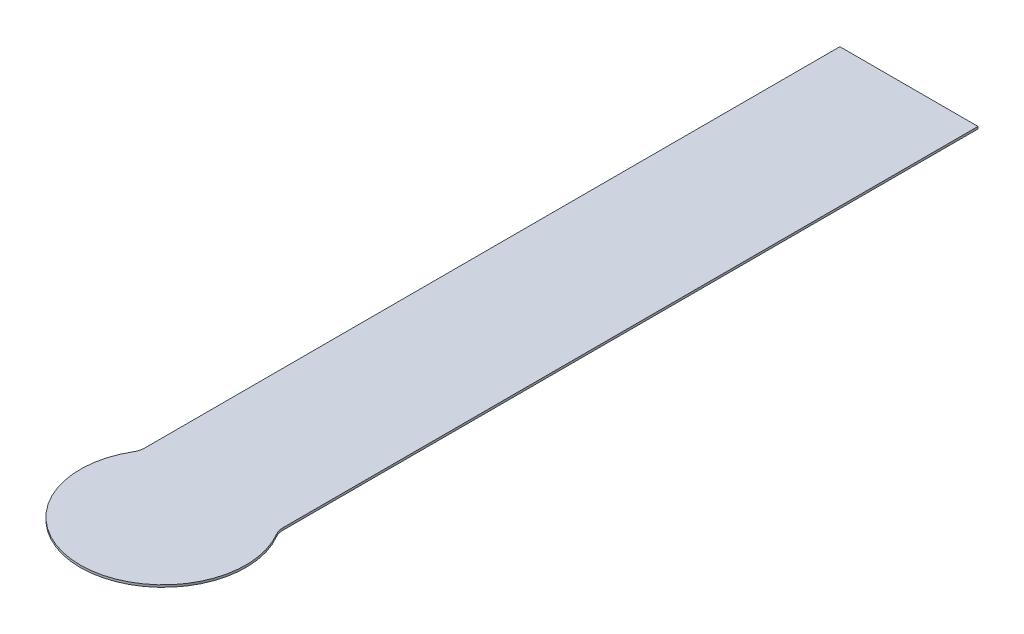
from build123d import *

# Parameters (mm, degrees)
EXTRUDE1_DEPTH = 0.1016


with BuildPart() as part:
    # Sketch1 → Extrude1 (new body)
    with BuildSketch(Plane(origin=(0, 0, 0), x_dir=(1, 0, 0), z_dir=(0, 1, 0))):
        with BuildLine():
            ThreePointArc((3.175, 2.338317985), (3.203408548, 2.125306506), (3.286648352, 1.927185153))
            ThreePointArc((3.286648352, 1.927185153), (0, -3.81), (-3.286648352, 1.927185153))
            ThreePointArc((-3.286648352, 1.927185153), (-3.203408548, 2.125306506), (-3.175, 2.338317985))
            Line((-3.175, 2.338317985), (-3.175, 34.29))
            Line((-3.175, 34.29), (3.175, 34.29))
            Line((3.175, 34.29), (3.175, 2.338317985))
        make_face()
    extrude(amount=EXTRUDE1_DEPTH)


solid = part.part
